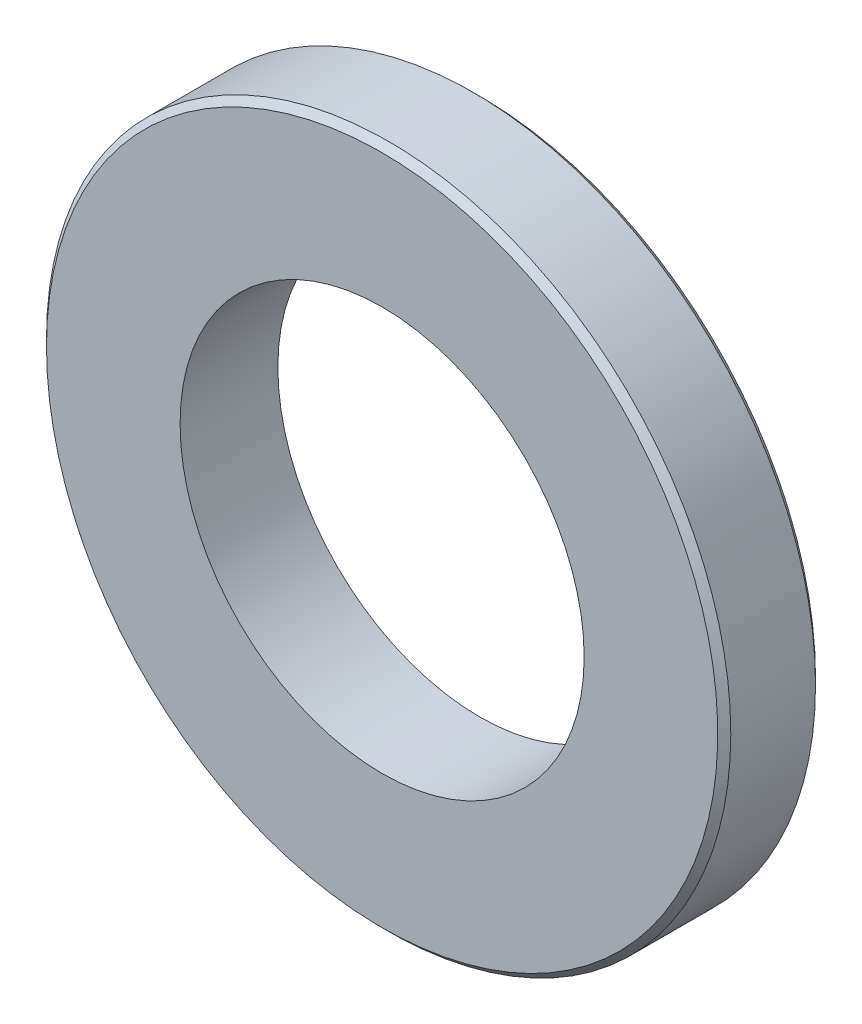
from build123d import *

# Parameters (mm, degrees)
ESQUISSE1_R          = 5.25
ESQUISSE1_R_2        = 3.1
BASE_EXTRUSION_DEPTH = 1.5
CHANFREIN1_SIZE      = 0.1


with BuildPart() as part:
    # Esquisse1 → Base-Extrusion (new body)
    with BuildSketch(Plane.XY):
        with Locations(Location((0, 0, 0), (0, 0, 180))):
            Circle(ESQUISSE1_R)
        with Locations(Location((0, 0, 0), (0, 0, 180))):
            Circle(ESQUISSE1_R_2, mode=Mode.SUBTRACT)
    extrude(amount=BASE_EXTRUSION_DEPTH)

    # Chanfrein1
    chanfrein1_edges = [part.edges().sort_by_distance(p)[0] for p in [
        (5.25, 0, 0),
        (5.25, 0, 1.5),
    ]]
    chamfer(chanfrein1_edges, length=CHANFREIN1_SIZE)


solid = part.part
